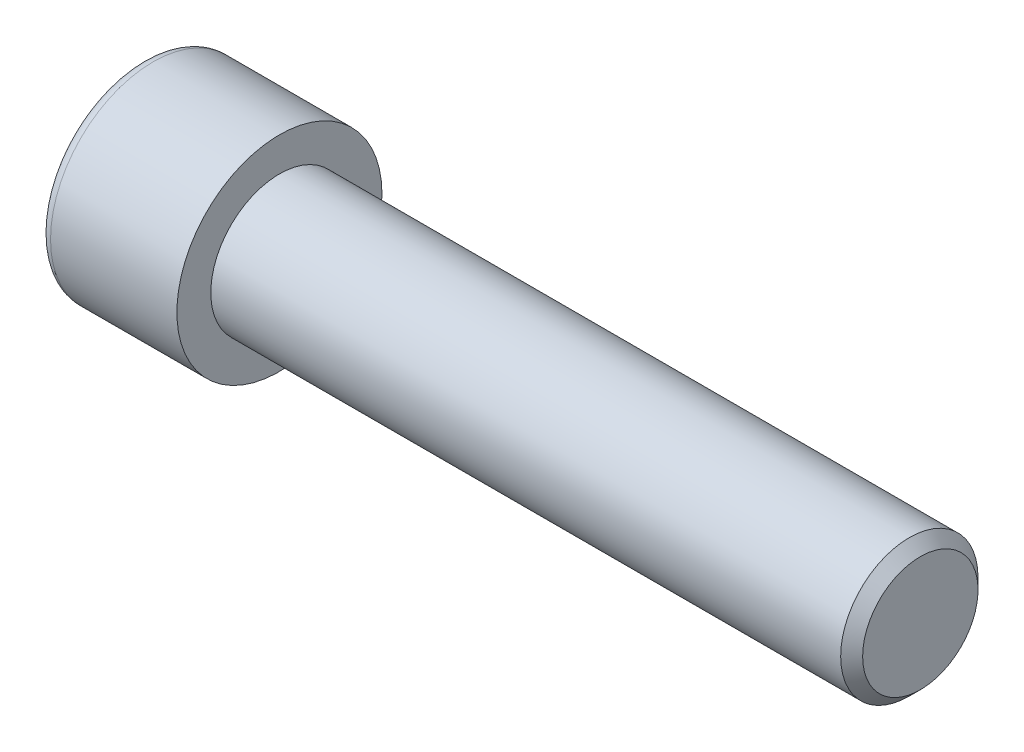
from build123d import *

# Parameters (mm, degrees)
CHAMFER1_SIZE      = 0.762
FILLET1_R          = 0.762
CUT_EXTRUDE1_DEPTH = 5.08


with BuildPart() as part:
    # Sketch1 → Revolve1 (revolve)
    with BuildSketch(Plane.XY, mode=Mode.PRIVATE) as revolve1_sk:
        Polygon((0, 0), (53.975, 0), (53.975, 4.7625), (9.525, 4.7625), (9.525, 7.112), (0, 7.112), align=None)
    revolve(revolve1_sk.sketch.rotate(Axis((0, 0, 0), (-1, 0, 0)), 90), axis=Axis((0, 0, 0), (-1, 0, 0)))

    # Chamfer1
    chamfer1_edges = [part.edges().sort_by_distance(p)[0] for p in [
        (53.975, 0, 4.7625),
    ]]
    chamfer(chamfer1_edges, length=CHAMFER1_SIZE)

    # Fillet1
    fillet1_edges = [part.edges().sort_by_distance(p)[0] for p in [
        (0, 0, 7.112),
    ]]
    fillet(fillet1_edges, radius=FILLET1_R)

    # Sketch2 → Cut-Extrude1 (cut)
    with BuildSketch(Plane.ZY):
        Polygon((-2.287692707, -3.9624), (2.287692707, -3.9624), (4.575385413, 0), (2.287692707, 3.9624), (-2.287692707, 3.9624), (-4.575385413, 0), align=None)
    extrude(amount=-CUT_EXTRUDE1_DEPTH, mode=Mode.SUBTRACT)


solid = part.part
